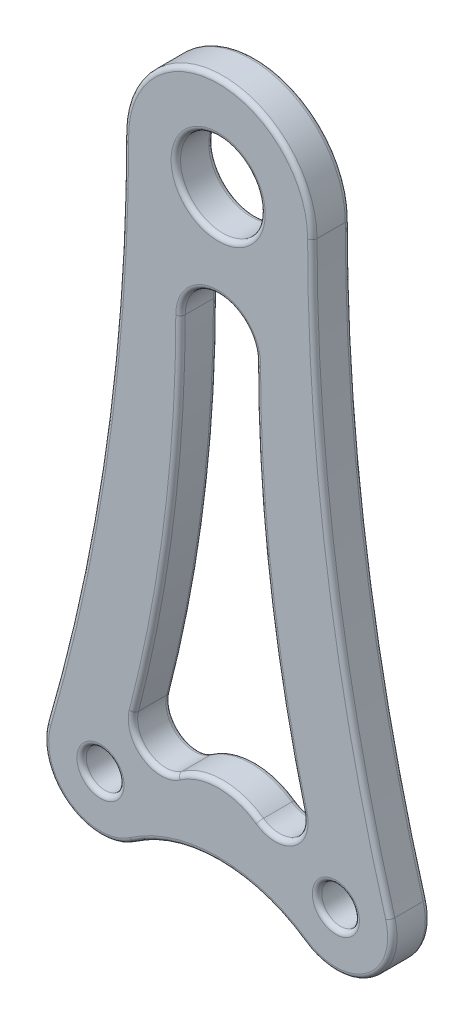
ISO-10303-21;
HEADER;
FILE_DESCRIPTION(('STEP AP214'),'2;1');
FILE_NAME('part.step','',(''),(''),'','','');
FILE_SCHEMA(('AUTOMOTIVE_DESIGN { 1 0 10303 214 1 1 1 1 }'));
ENDSEC;
DATA;
#1=APPLICATION_CONTEXT('core data for automotive mechanical design processes');
#2=APPLICATION_PROTOCOL_DEFINITION('international standard','automotive_design',2000,#1);
#3=PRODUCT_CONTEXT('',#1,'mechanical');
#4=PRODUCT('Part','Part','',(#3));
#5=PRODUCT_RELATED_PRODUCT_CATEGORY('part','',(#4));
#6=PRODUCT_DEFINITION_FORMATION('','',#4);
#7=PRODUCT_DEFINITION_CONTEXT('part definition',#1,'design');
#8=PRODUCT_DEFINITION('design','',#6,#7);
#9=PRODUCT_DEFINITION_SHAPE('','',#8);
#10=(LENGTH_UNIT() NAMED_UNIT(*) SI_UNIT(.MILLI.,.METRE.));
#11=(NAMED_UNIT(*) PLANE_ANGLE_UNIT() SI_UNIT($,.RADIAN.));
#12=(NAMED_UNIT(*) SI_UNIT($,.STERADIAN.) SOLID_ANGLE_UNIT());
#13=UNCERTAINTY_MEASURE_WITH_UNIT(LENGTH_MEASURE(1.E-05),#10,'distance_accuracy_value','');
#14=(GEOMETRIC_REPRESENTATION_CONTEXT(3) GLOBAL_UNCERTAINTY_ASSIGNED_CONTEXT((#13)) GLOBAL_UNIT_ASSIGNED_CONTEXT((#10,
#11,#12)) REPRESENTATION_CONTEXT('',''));
#15=CARTESIAN_POINT('',(0.,0.,0.));
#16=DIRECTION('',(0.,0.,1.));
#17=DIRECTION('',(1.,0.,0.));
#18=AXIS2_PLACEMENT_3D('',#15,#16,#17);
#19=CARTESIAN_POINT('',(-6.24999999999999,-69.0519334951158,2.));
#20=DIRECTION('',(0.,0.,1.));
#21=DIRECTION('',(1.,0.,0.));
#22=AXIS2_PLACEMENT_3D('',#19,#20,#21);
#23=PLANE('',#22);
#24=CARTESIAN_POINT('',(12.5,-60.,2.));
#25=DIRECTION('',(0.,0.,1.));
#26=DIRECTION('',(1.,0.,0.));
#27=AXIS2_PLACEMENT_3D('',#24,#25,#26);
#28=CIRCLE('',#27,2.5);
#29=CARTESIAN_POINT('',(15.,-60.,2.));
#30=VERTEX_POINT('',#29);
#31=EDGE_CURVE('E11',#30,#30,#28,.F.);
#32=ORIENTED_EDGE('',*,*,#31,.T.);
#33=EDGE_LOOP('',(#32));
#34=FACE_BOUND('',#33,.T.);
#35=CARTESIAN_POINT('',(0.,-14.,2.));
#36=DIRECTION('',(0.,0.,1.));
#37=DIRECTION('',(1.,0.,0.));
#38=AXIS2_PLACEMENT_3D('',#35,#36,#37);
#39=CIRCLE('',#38,4.5);
#40=CARTESIAN_POINT('',(-4.5,-14.,2.));
#41=VERTEX_POINT('',#40);
#42=CARTESIAN_POINT('',(4.5,-14.,2.));
#43=VERTEX_POINT('',#42);
#44=EDGE_CURVE('E47',#41,#43,#39,.F.);
#45=ORIENTED_EDGE('',*,*,#44,.T.);
#46=CARTESIAN_POINT('',(159.573514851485,-14.,2.));
#47=DIRECTION('',(0.,0.,1.));
#48=DIRECTION('',(1.,0.,0.));
#49=AXIS2_PLACEMENT_3D('',#46,#47,#48);
#50=CIRCLE('',#49,155.073514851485);
#51=CARTESIAN_POINT('',(9.43853750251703,-52.8237502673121,2.));
#52=VERTEX_POINT('',#51);
#53=EDGE_CURVE('E39',#43,#52,#50,.T.);
#54=ORIENTED_EDGE('',*,*,#53,.T.);
#55=CARTESIAN_POINT('',(6.05,-53.7,2.));
#56=DIRECTION('',(0.,0.,1.));
#57=DIRECTION('',(1.,0.,0.));
#58=AXIS2_PLACEMENT_3D('',#55,#56,#57);
#59=CIRCLE('',#58,3.5);
#60=CARTESIAN_POINT('',(4.03333333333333,-56.5606040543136,2.));
#61=VERTEX_POINT('',#60);
#62=EDGE_CURVE('E329',#52,#61,#59,.F.);
#63=ORIENTED_EDGE('',*,*,#62,.T.);
#64=CARTESIAN_POINT('',(0.,-62.2818121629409,2.));
#65=DIRECTION('',(0.,0.,1.));
#66=DIRECTION('',(1.,0.,0.));
#67=AXIS2_PLACEMENT_3D('',#64,#65,#66);
#68=CIRCLE('',#67,6.99999999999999);
#69=CARTESIAN_POINT('',(-4.03333333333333,-56.5606040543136,2.));
#70=VERTEX_POINT('',#69);
#71=EDGE_CURVE('E331',#61,#70,#68,.T.);
#72=ORIENTED_EDGE('',*,*,#71,.T.);
#73=CARTESIAN_POINT('',(-6.04999999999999,-53.7,2.));
#74=DIRECTION('',(0.,0.,1.));
#75=DIRECTION('',(1.,0.,0.));
#76=AXIS2_PLACEMENT_3D('',#73,#74,#75);
#77=CIRCLE('',#76,3.5);
#78=CARTESIAN_POINT('',(-9.43853750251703,-52.8237502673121,2.));
#79=VERTEX_POINT('',#78);
#80=EDGE_CURVE('E333',#70,#79,#77,.F.);
#81=ORIENTED_EDGE('',*,*,#80,.T.);
#82=CARTESIAN_POINT('',(-159.573514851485,-14.,2.));
#83=DIRECTION('',(0.,0.,1.));
#84=DIRECTION('',(1.,0.,0.));
#85=AXIS2_PLACEMENT_3D('',#82,#83,#84);
#86=CIRCLE('',#85,155.073514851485);
#87=EDGE_CURVE('E52',#79,#41,#86,.T.);
#88=ORIENTED_EDGE('',*,*,#87,.T.);
#89=EDGE_LOOP('',(#45,#54,#63,#72,#81,#88));
#90=FACE_BOUND('',#89,.T.);
#91=CARTESIAN_POINT('',(-220.014705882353,0.,2.));
#92=DIRECTION('',(0.,0.,1.));
#93=DIRECTION('',(1.,0.,0.));
#94=AXIS2_PLACEMENT_3D('',#91,#92,#93);
#95=CIRCLE('',#94,210.514705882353);
#96=CARTESIAN_POINT('',(-9.5,0.,2.));
#97=VERTEX_POINT('',#96);
#98=CARTESIAN_POINT('',(-17.7835795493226,-58.4723262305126,2.));
#99=VERTEX_POINT('',#98);
#100=EDGE_CURVE('E324',#97,#99,#95,.F.);
#101=ORIENTED_EDGE('',*,*,#100,.T.);
#102=CARTESIAN_POINT('',(-12.5,-60.,2.));
#103=DIRECTION('',(0.,0.,1.));
#104=DIRECTION('',(1.,0.,0.));
#105=AXIS2_PLACEMENT_3D('',#102,#103,#104);
#106=CIRCLE('',#105,5.5);
#107=CARTESIAN_POINT('',(-9.37499999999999,-64.5259667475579,2.));
#108=VERTEX_POINT('',#107);
#109=EDGE_CURVE('E326',#99,#108,#106,.T.);
#110=ORIENTED_EDGE('',*,*,#109,.T.);
#111=CARTESIAN_POINT('',(0.,-78.1038669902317,2.));
#112=DIRECTION('',(0.,0.,1.));
#113=DIRECTION('',(1.,0.,0.));
#114=AXIS2_PLACEMENT_3D('',#111,#112,#113);
#115=CIRCLE('',#114,16.5);
#116=CARTESIAN_POINT('',(9.37500000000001,-64.5259667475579,2.));
#117=VERTEX_POINT('',#116);
#118=EDGE_CURVE('E316',#108,#117,#115,.F.);
#119=ORIENTED_EDGE('',*,*,#118,.T.);
#120=CARTESIAN_POINT('',(12.5,-60.,2.));
#121=DIRECTION('',(0.,0.,1.));
#122=DIRECTION('',(1.,0.,0.));
#123=AXIS2_PLACEMENT_3D('',#120,#121,#122);
#124=CIRCLE('',#123,5.5);
#125=CARTESIAN_POINT('',(17.7835795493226,-58.4723262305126,2.));
#126=VERTEX_POINT('',#125);
#127=EDGE_CURVE('E318',#117,#126,#124,.T.);
#128=ORIENTED_EDGE('',*,*,#127,.T.);
#129=CARTESIAN_POINT('',(220.014705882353,0.,2.));
#130=DIRECTION('',(0.,0.,1.));
#131=DIRECTION('',(1.,0.,0.));
#132=AXIS2_PLACEMENT_3D('',#129,#130,#131);
#133=CIRCLE('',#132,210.514705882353);
#134=CARTESIAN_POINT('',(9.49999999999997,0.,2.));
#135=VERTEX_POINT('',#134);
#136=EDGE_CURVE('E320',#126,#135,#133,.F.);
#137=ORIENTED_EDGE('',*,*,#136,.T.);
#138=CARTESIAN_POINT('',(0.,0.,2.));
#139=DIRECTION('',(0.,0.,1.));
#140=DIRECTION('',(1.,0.,0.));
#141=AXIS2_PLACEMENT_3D('',#138,#139,#140);
#142=CIRCLE('',#141,9.5);
#143=EDGE_CURVE('E322',#135,#97,#142,.T.);
#144=ORIENTED_EDGE('',*,*,#143,.T.);
#145=EDGE_LOOP('',(#101,#110,#119,#128,#137,#144));
#146=FACE_BOUND('',#145,.T.);
#147=CARTESIAN_POINT('',(0.,0.,2.));
#148=DIRECTION('',(0.,0.,1.));
#149=DIRECTION('',(1.,0.,0.));
#150=AXIS2_PLACEMENT_3D('',#147,#148,#149);
#151=CIRCLE('',#150,5.);
#152=CARTESIAN_POINT('',(5.,0.,2.));
#153=VERTEX_POINT('',#152);
#154=EDGE_CURVE('E313',#153,#153,#151,.F.);
#155=ORIENTED_EDGE('',*,*,#154,.T.);
#156=EDGE_LOOP('',(#155));
#157=FACE_BOUND('',#156,.T.);
#158=CARTESIAN_POINT('',(-12.5,-60.,2.));
#159=DIRECTION('',(0.,0.,1.));
#160=DIRECTION('',(1.,0.,0.));
#161=AXIS2_PLACEMENT_3D('',#158,#159,#160);
#162=CIRCLE('',#161,2.5);
#163=CARTESIAN_POINT('',(-9.99999999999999,-60.,2.));
#164=VERTEX_POINT('',#163);
#165=EDGE_CURVE('E310',#164,#164,#162,.F.);
#166=ORIENTED_EDGE('',*,*,#165,.T.);
#167=EDGE_LOOP('',(#166));
#168=FACE_BOUND('',#167,.T.);
#169=ADVANCED_FACE('F30',(#34,#90,#146,#157,#168),#23,.T.);
#170=CARTESIAN_POINT('',(-6.24999999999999,-69.0519334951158,-2.));
#171=DIRECTION('',(0.,0.,1.));
#172=DIRECTION('',(1.,0.,0.));
#173=AXIS2_PLACEMENT_3D('',#170,#171,#172);
#174=PLANE('',#173);
#175=CARTESIAN_POINT('',(12.5,-60.,-2.));
#176=DIRECTION('',(0.,0.,1.));
#177=DIRECTION('',(1.,0.,0.));
#178=AXIS2_PLACEMENT_3D('',#175,#176,#177);
#179=CIRCLE('',#178,2.5);
#180=CARTESIAN_POINT('',(15.,-60.,-2.));
#181=VERTEX_POINT('',#180);
#182=EDGE_CURVE('E239',#181,#181,#179,.T.);
#183=ORIENTED_EDGE('',*,*,#182,.T.);
#184=EDGE_LOOP('',(#183));
#185=FACE_BOUND('',#184,.T.);
#186=CARTESIAN_POINT('',(-159.573514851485,-14.,-2.));
#187=DIRECTION('',(0.,0.,1.));
#188=DIRECTION('',(1.,0.,0.));
#189=AXIS2_PLACEMENT_3D('',#186,#187,#188);
#190=CIRCLE('',#189,155.073514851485);
#191=CARTESIAN_POINT('',(-4.5,-14.,-2.));
#192=VERTEX_POINT('',#191);
#193=CARTESIAN_POINT('',(-9.43853750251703,-52.8237502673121,-2.));
#194=VERTEX_POINT('',#193);
#195=EDGE_CURVE('E234',#192,#194,#190,.F.);
#196=ORIENTED_EDGE('',*,*,#195,.T.);
#197=CARTESIAN_POINT('',(-6.04999999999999,-53.7,-2.));
#198=DIRECTION('',(0.,0.,1.));
#199=DIRECTION('',(1.,0.,0.));
#200=AXIS2_PLACEMENT_3D('',#197,#198,#199);
#201=CIRCLE('',#200,3.5);
#202=CARTESIAN_POINT('',(-4.03333333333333,-56.5606040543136,-2.));
#203=VERTEX_POINT('',#202);
#204=EDGE_CURVE('E236',#194,#203,#201,.T.);
#205=ORIENTED_EDGE('',*,*,#204,.T.);
#206=CARTESIAN_POINT('',(0.,-62.2818121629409,-2.));
#207=DIRECTION('',(0.,0.,1.));
#208=DIRECTION('',(1.,0.,0.));
#209=AXIS2_PLACEMENT_3D('',#206,#207,#208);
#210=CIRCLE('',#209,6.99999999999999);
#211=CARTESIAN_POINT('',(4.03333333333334,-56.5606040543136,-2.));
#212=VERTEX_POINT('',#211);
#213=EDGE_CURVE('E221',#203,#212,#210,.F.);
#214=ORIENTED_EDGE('',*,*,#213,.T.);
#215=CARTESIAN_POINT('',(6.05,-53.7,-2.));
#216=DIRECTION('',(0.,0.,1.));
#217=DIRECTION('',(1.,0.,0.));
#218=AXIS2_PLACEMENT_3D('',#215,#216,#217);
#219=CIRCLE('',#218,3.5);
#220=CARTESIAN_POINT('',(9.43853750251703,-52.8237502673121,-2.));
#221=VERTEX_POINT('',#220);
#222=EDGE_CURVE('E223',#212,#221,#219,.T.);
#223=ORIENTED_EDGE('',*,*,#222,.T.);
#224=CARTESIAN_POINT('',(159.573514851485,-14.,-2.));
#225=DIRECTION('',(0.,0.,1.));
#226=DIRECTION('',(1.,0.,0.));
#227=AXIS2_PLACEMENT_3D('',#224,#225,#226);
#228=CIRCLE('',#227,155.073514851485);
#229=CARTESIAN_POINT('',(4.5,-14.,-2.));
#230=VERTEX_POINT('',#229);
#231=EDGE_CURVE('E230',#221,#230,#228,.F.);
#232=ORIENTED_EDGE('',*,*,#231,.T.);
#233=CARTESIAN_POINT('',(0.,-14.,-2.));
#234=DIRECTION('',(0.,0.,1.));
#235=DIRECTION('',(1.,0.,0.));
#236=AXIS2_PLACEMENT_3D('',#233,#234,#235);
#237=CIRCLE('',#236,4.5);
#238=EDGE_CURVE('E232',#230,#192,#237,.T.);
#239=ORIENTED_EDGE('',*,*,#238,.T.);
#240=EDGE_LOOP('',(#196,#205,#214,#223,#232,#239));
#241=FACE_BOUND('',#240,.T.);
#242=CARTESIAN_POINT('',(220.014705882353,0.,-2.));
#243=DIRECTION('',(0.,0.,1.));
#244=DIRECTION('',(1.,0.,0.));
#245=AXIS2_PLACEMENT_3D('',#242,#243,#244);
#246=CIRCLE('',#245,210.514705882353);
#247=CARTESIAN_POINT('',(9.5,0.,-2.));
#248=VERTEX_POINT('',#247);
#249=CARTESIAN_POINT('',(17.7835795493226,-58.4723262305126,-2.));
#250=VERTEX_POINT('',#249);
#251=EDGE_CURVE('E220',#248,#250,#246,.T.);
#252=ORIENTED_EDGE('',*,*,#251,.T.);
#253=CARTESIAN_POINT('',(12.5,-60.,-2.));
#254=DIRECTION('',(0.,0.,1.));
#255=DIRECTION('',(1.,0.,0.));
#256=AXIS2_PLACEMENT_3D('',#253,#254,#255);
#257=CIRCLE('',#256,5.5);
#258=CARTESIAN_POINT('',(9.37500000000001,-64.5259667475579,-2.));
#259=VERTEX_POINT('',#258);
#260=EDGE_CURVE('E198',#250,#259,#257,.F.);
#261=ORIENTED_EDGE('',*,*,#260,.T.);
#262=CARTESIAN_POINT('',(0.,-78.1038669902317,-2.));
#263=DIRECTION('',(0.,0.,1.));
#264=DIRECTION('',(1.,0.,0.));
#265=AXIS2_PLACEMENT_3D('',#262,#263,#264);
#266=CIRCLE('',#265,16.5);
#267=CARTESIAN_POINT('',(-9.37499999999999,-64.5259667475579,-2.));
#268=VERTEX_POINT('',#267);
#269=EDGE_CURVE('E208',#259,#268,#266,.T.);
#270=ORIENTED_EDGE('',*,*,#269,.T.);
#271=CARTESIAN_POINT('',(-12.5,-60.,-2.));
#272=DIRECTION('',(0.,0.,1.));
#273=DIRECTION('',(1.,0.,0.));
#274=AXIS2_PLACEMENT_3D('',#271,#272,#273);
#275=CIRCLE('',#274,5.5);
#276=CARTESIAN_POINT('',(-17.7835795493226,-58.4723262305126,-2.));
#277=VERTEX_POINT('',#276);
#278=EDGE_CURVE('E214',#268,#277,#275,.F.);
#279=ORIENTED_EDGE('',*,*,#278,.T.);
#280=CARTESIAN_POINT('',(-220.014705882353,0.,-2.));
#281=DIRECTION('',(0.,0.,1.));
#282=DIRECTION('',(1.,0.,0.));
#283=AXIS2_PLACEMENT_3D('',#280,#281,#282);
#284=CIRCLE('',#283,210.514705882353);
#285=CARTESIAN_POINT('',(-9.49999999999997,0.,-2.));
#286=VERTEX_POINT('',#285);
#287=EDGE_CURVE('E432',#277,#286,#284,.T.);
#288=ORIENTED_EDGE('',*,*,#287,.T.);
#289=CARTESIAN_POINT('',(0.,0.,-2.));
#290=DIRECTION('',(0.,0.,1.));
#291=DIRECTION('',(1.,0.,0.));
#292=AXIS2_PLACEMENT_3D('',#289,#290,#291);
#293=CIRCLE('',#292,9.5);
#294=EDGE_CURVE('E225',#286,#248,#293,.F.);
#295=ORIENTED_EDGE('',*,*,#294,.T.);
#296=EDGE_LOOP('',(#252,#261,#270,#279,#288,#295));
#297=FACE_BOUND('',#296,.T.);
#298=CARTESIAN_POINT('',(0.,0.,-2.));
#299=DIRECTION('',(0.,0.,1.));
#300=DIRECTION('',(1.,0.,0.));
#301=AXIS2_PLACEMENT_3D('',#298,#299,#300);
#302=CIRCLE('',#301,5.);
#303=CARTESIAN_POINT('',(5.,0.,-2.));
#304=VERTEX_POINT('',#303);
#305=EDGE_CURVE('E215',#304,#304,#302,.T.);
#306=ORIENTED_EDGE('',*,*,#305,.T.);
#307=EDGE_LOOP('',(#306));
#308=FACE_BOUND('',#307,.T.);
#309=CARTESIAN_POINT('',(-12.5,-60.,-2.));
#310=DIRECTION('',(0.,0.,1.));
#311=DIRECTION('',(1.,0.,0.));
#312=AXIS2_PLACEMENT_3D('',#309,#310,#311);
#313=CIRCLE('',#312,2.5);
#314=CARTESIAN_POINT('',(-9.99999999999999,-60.,-2.));
#315=VERTEX_POINT('',#314);
#316=EDGE_CURVE('E421',#315,#315,#313,.T.);
#317=ORIENTED_EDGE('',*,*,#316,.T.);
#318=EDGE_LOOP('',(#317));
#319=FACE_BOUND('',#318,.T.);
#320=ADVANCED_FACE('F217',(#185,#241,#297,#308,#319),#174,.F.);
#321=CARTESIAN_POINT('',(0.,-78.1038669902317,2.));
#322=DIRECTION('',(0.,0.,-1.));
#323=DIRECTION('',(-1.,0.,0.));
#324=AXIS2_PLACEMENT_3D('',#321,#322,#323);
#325=CYLINDRICAL_SURFACE('',#324,16.);
#326=DIRECTION('',(0.,0.,-1.));
#327=VECTOR('',#326,1.);
#328=CARTESIAN_POINT('',(-9.09090909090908,-64.9374182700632,2.));
#329=LINE('',#328,#327);
#330=CARTESIAN_POINT('',(-9.09090909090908,-64.9374182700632,1.5));
#331=VERTEX_POINT('',#330);
#332=CARTESIAN_POINT('',(-9.09090909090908,-64.9374182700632,-1.5));
#333=VERTEX_POINT('',#332);
#334=EDGE_CURVE('E451',#331,#333,#329,.T.);
#335=ORIENTED_EDGE('',*,*,#334,.T.);
#336=CARTESIAN_POINT('',(0.,-78.1038669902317,-1.5));
#337=DIRECTION('',(0.,0.,1.));
#338=DIRECTION('',(1.,0.,0.));
#339=AXIS2_PLACEMENT_3D('',#336,#337,#338);
#340=CIRCLE('',#339,16.);
#341=CARTESIAN_POINT('',(9.0909090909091,-64.9374182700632,-1.5));
#342=VERTEX_POINT('',#341);
#343=EDGE_CURVE('E296',#333,#342,#340,.F.);
#344=ORIENTED_EDGE('',*,*,#343,.T.);
#345=DIRECTION('',(0.,0.,-1.));
#346=VECTOR('',#345,1.);
#347=CARTESIAN_POINT('',(9.0909090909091,-64.9374182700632,2.));
#348=LINE('',#347,#346);
#349=CARTESIAN_POINT('',(9.0909090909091,-64.9374182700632,1.5));
#350=VERTEX_POINT('',#349);
#351=EDGE_CURVE('E419',#350,#342,#348,.T.);
#352=ORIENTED_EDGE('',*,*,#351,.F.);
#353=CARTESIAN_POINT('',(0.,-78.1038669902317,1.5));
#354=DIRECTION('',(0.,0.,1.));
#355=DIRECTION('',(1.,0.,0.));
#356=AXIS2_PLACEMENT_3D('',#353,#354,#355);
#357=CIRCLE('',#356,16.);
#358=EDGE_CURVE('E294',#350,#331,#357,.T.);
#359=ORIENTED_EDGE('',*,*,#358,.T.);
#360=EDGE_LOOP('',(#335,#344,#352,#359));
#361=FACE_BOUND('',#360,.T.);
#362=ADVANCED_FACE('F561',(#361),#325,.F.);
#363=CARTESIAN_POINT('',(12.5,-60.,2.));
#364=DIRECTION('',(0.,0.,-1.));
#365=DIRECTION('',(-1.,0.,0.));
#366=AXIS2_PLACEMENT_3D('',#363,#364,#365);
#367=CYLINDRICAL_SURFACE('',#366,6.);
#368=ORIENTED_EDGE('',*,*,#351,.T.);
#369=CARTESIAN_POINT('',(12.5,-60.,-1.5));
#370=DIRECTION('',(0.,0.,1.));
#371=DIRECTION('',(1.,0.,0.));
#372=AXIS2_PLACEMENT_3D('',#369,#370,#371);
#373=CIRCLE('',#372,6.);
#374=CARTESIAN_POINT('',(18.2639049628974,-58.3334467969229,-1.5));
#375=VERTEX_POINT('',#374);
#376=EDGE_CURVE('E201',#342,#375,#373,.T.);
#377=ORIENTED_EDGE('',*,*,#376,.T.);
#378=DIRECTION('',(0.,0.,-1.));
#379=VECTOR('',#378,1.);
#380=CARTESIAN_POINT('',(18.2639049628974,-58.3334467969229,2.));
#381=LINE('',#380,#379);
#382=CARTESIAN_POINT('',(18.2639049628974,-58.3334467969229,1.5));
#383=VERTEX_POINT('',#382);
#384=EDGE_CURVE('E412',#383,#375,#381,.T.);
#385=ORIENTED_EDGE('',*,*,#384,.F.);
#386=CARTESIAN_POINT('',(12.5,-60.,1.5));
#387=DIRECTION('',(0.,0.,1.));
#388=DIRECTION('',(1.,0.,0.));
#389=AXIS2_PLACEMENT_3D('',#386,#387,#388);
#390=CIRCLE('',#389,6.);
#391=EDGE_CURVE('E274',#383,#350,#390,.F.);
#392=ORIENTED_EDGE('',*,*,#391,.T.);
#393=EDGE_LOOP('',(#368,#377,#385,#392));
#394=FACE_BOUND('',#393,.T.);
#395=ADVANCED_FACE('F417',(#394),#367,.T.);
#396=CARTESIAN_POINT('',(220.014705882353,0.,2.));
#397=DIRECTION('',(0.,0.,-1.));
#398=DIRECTION('',(-1.,0.,0.));
#399=AXIS2_PLACEMENT_3D('',#396,#397,#398);
#400=CYLINDRICAL_SURFACE('',#399,210.014705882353);
#401=ORIENTED_EDGE('',*,*,#384,.T.);
#402=CARTESIAN_POINT('',(220.014705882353,0.,-1.5));
#403=DIRECTION('',(0.,0.,1.));
#404=DIRECTION('',(1.,0.,0.));
#405=AXIS2_PLACEMENT_3D('',#402,#403,#404);
#406=CIRCLE('',#405,210.014705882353);
#407=CARTESIAN_POINT('',(10.,0.,-1.5));
#408=VERTEX_POINT('',#407);
#409=EDGE_CURVE('E279',#375,#408,#406,.F.);
#410=ORIENTED_EDGE('',*,*,#409,.T.);
#411=DIRECTION('',(0.,0.,-1.));
#412=VECTOR('',#411,1.);
#413=CARTESIAN_POINT('',(10.,0.,2.));
#414=LINE('',#413,#412);
#415=CARTESIAN_POINT('',(10.,0.,1.5));
#416=VERTEX_POINT('',#415);
#417=EDGE_CURVE('E414',#416,#408,#414,.T.);
#418=ORIENTED_EDGE('',*,*,#417,.F.);
#419=CARTESIAN_POINT('',(220.014705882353,0.,1.5));
#420=DIRECTION('',(0.,0.,1.));
#421=DIRECTION('',(1.,0.,0.));
#422=AXIS2_PLACEMENT_3D('',#419,#420,#421);
#423=CIRCLE('',#422,210.014705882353);
#424=EDGE_CURVE('E277',#416,#383,#423,.T.);
#425=ORIENTED_EDGE('',*,*,#424,.T.);
#426=EDGE_LOOP('',(#401,#410,#418,#425));
#427=FACE_BOUND('',#426,.T.);
#428=ADVANCED_FACE('F411',(#427),#400,.F.);
#429=CARTESIAN_POINT('',(0.,0.,2.));
#430=DIRECTION('',(0.,0.,-1.));
#431=DIRECTION('',(-1.,0.,0.));
#432=AXIS2_PLACEMENT_3D('',#429,#430,#431);
#433=CYLINDRICAL_SURFACE('',#432,10.);
#434=ORIENTED_EDGE('',*,*,#417,.T.);
#435=CARTESIAN_POINT('',(0.,0.,-1.5));
#436=DIRECTION('',(0.,0.,1.));
#437=DIRECTION('',(1.,0.,0.));
#438=AXIS2_PLACEMENT_3D('',#435,#436,#437);
#439=CIRCLE('',#438,10.);
#440=CARTESIAN_POINT('',(-9.99999999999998,0.,-1.5));
#441=VERTEX_POINT('',#440);
#442=EDGE_CURVE('E283',#408,#441,#439,.T.);
#443=ORIENTED_EDGE('',*,*,#442,.T.);
#444=DIRECTION('',(0.,0.,-1.));
#445=VECTOR('',#444,1.);
#446=CARTESIAN_POINT('',(-9.99999999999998,0.,2.));
#447=LINE('',#446,#445);
#448=CARTESIAN_POINT('',(-9.99999999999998,0.,1.5));
#449=VERTEX_POINT('',#448);
#450=EDGE_CURVE('E423',#449,#441,#447,.T.);
#451=ORIENTED_EDGE('',*,*,#450,.F.);
#452=CARTESIAN_POINT('',(0.,0.,1.5));
#453=DIRECTION('',(0.,0.,1.));
#454=DIRECTION('',(1.,0.,0.));
#455=AXIS2_PLACEMENT_3D('',#452,#453,#454);
#456=CIRCLE('',#455,10.);
#457=EDGE_CURVE('E281',#449,#416,#456,.F.);
#458=ORIENTED_EDGE('',*,*,#457,.T.);
#459=EDGE_LOOP('',(#434,#443,#451,#458));
#460=FACE_BOUND('',#459,.T.);
#461=ADVANCED_FACE('F444',(#460),#433,.T.);
#462=CARTESIAN_POINT('',(-220.014705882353,0.,2.));
#463=DIRECTION('',(0.,0.,-1.));
#464=DIRECTION('',(-1.,0.,0.));
#465=AXIS2_PLACEMENT_3D('',#462,#463,#464);
#466=CYLINDRICAL_SURFACE('',#465,210.014705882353);
#467=ORIENTED_EDGE('',*,*,#450,.T.);
#468=CARTESIAN_POINT('',(-220.014705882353,0.,-1.5));
#469=DIRECTION('',(0.,0.,1.));
#470=DIRECTION('',(1.,0.,0.));
#471=AXIS2_PLACEMENT_3D('',#468,#469,#470);
#472=CIRCLE('',#471,210.014705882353);
#473=CARTESIAN_POINT('',(-18.2639049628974,-58.3334467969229,-1.5));
#474=VERTEX_POINT('',#473);
#475=EDGE_CURVE('E287',#441,#474,#472,.F.);
#476=ORIENTED_EDGE('',*,*,#475,.T.);
#477=DIRECTION('',(0.,0.,-1.));
#478=VECTOR('',#477,1.);
#479=CARTESIAN_POINT('',(-18.2639049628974,-58.3334467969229,2.));
#480=LINE('',#479,#478);
#481=CARTESIAN_POINT('',(-18.2639049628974,-58.3334467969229,1.5));
#482=VERTEX_POINT('',#481);
#483=EDGE_CURVE('E449',#482,#474,#480,.T.);
#484=ORIENTED_EDGE('',*,*,#483,.F.);
#485=CARTESIAN_POINT('',(-220.014705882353,0.,1.5));
#486=DIRECTION('',(0.,0.,1.));
#487=DIRECTION('',(1.,0.,0.));
#488=AXIS2_PLACEMENT_3D('',#485,#486,#487);
#489=CIRCLE('',#488,210.014705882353);
#490=EDGE_CURVE('E285',#482,#449,#489,.T.);
#491=ORIENTED_EDGE('',*,*,#490,.T.);
#492=EDGE_LOOP('',(#467,#476,#484,#491));
#493=FACE_BOUND('',#492,.T.);
#494=ADVANCED_FACE('F571',(#493),#466,.F.);
#495=CARTESIAN_POINT('',(-12.5,-60.,2.));
#496=DIRECTION('',(0.,0.,-1.));
#497=DIRECTION('',(-1.,0.,0.));
#498=AXIS2_PLACEMENT_3D('',#495,#496,#497);
#499=CYLINDRICAL_SURFACE('',#498,6.);
#500=ORIENTED_EDGE('',*,*,#483,.T.);
#501=CARTESIAN_POINT('',(-12.5,-60.,-1.5));
#502=DIRECTION('',(0.,0.,1.));
#503=DIRECTION('',(1.,0.,0.));
#504=AXIS2_PLACEMENT_3D('',#501,#502,#503);
#505=CIRCLE('',#504,6.);
#506=EDGE_CURVE('E292',#474,#333,#505,.T.);
#507=ORIENTED_EDGE('',*,*,#506,.T.);
#508=ORIENTED_EDGE('',*,*,#334,.F.);
#509=CARTESIAN_POINT('',(-12.5,-60.,1.5));
#510=DIRECTION('',(0.,0.,1.));
#511=DIRECTION('',(1.,0.,0.));
#512=AXIS2_PLACEMENT_3D('',#509,#510,#511);
#513=CIRCLE('',#512,6.);
#514=EDGE_CURVE('E289',#331,#482,#513,.F.);
#515=ORIENTED_EDGE('',*,*,#514,.T.);
#516=EDGE_LOOP('',(#500,#507,#508,#515));
#517=FACE_BOUND('',#516,.T.);
#518=ADVANCED_FACE('F568',(#517),#499,.T.);
#519=CARTESIAN_POINT('',(0.,0.,2.));
#520=DIRECTION('',(0.,0.,-1.));
#521=DIRECTION('',(-1.,0.,0.));
#522=AXIS2_PLACEMENT_3D('',#519,#520,#521);
#523=CYLINDRICAL_SURFACE('',#522,4.5);
#524=CARTESIAN_POINT('',(0.,0.,-1.5));
#525=DIRECTION('',(0.,0.,1.));
#526=DIRECTION('',(1.,0.,0.));
#527=AXIS2_PLACEMENT_3D('',#524,#525,#526);
#528=CIRCLE('',#527,4.5);
#529=CARTESIAN_POINT('',(4.5,0.,-1.5));
#530=VERTEX_POINT('',#529);
#531=EDGE_CURVE('E301',#530,#530,#528,.F.);
#532=ORIENTED_EDGE('',*,*,#531,.T.);
#533=EDGE_LOOP('',(#532));
#534=FACE_BOUND('',#533,.T.);
#535=CARTESIAN_POINT('',(0.,0.,1.5));
#536=DIRECTION('',(0.,0.,1.));
#537=DIRECTION('',(1.,0.,0.));
#538=AXIS2_PLACEMENT_3D('',#535,#536,#537);
#539=CIRCLE('',#538,4.5);
#540=CARTESIAN_POINT('',(4.5,0.,1.5));
#541=VERTEX_POINT('',#540);
#542=EDGE_CURVE('E298',#541,#541,#539,.T.);
#543=ORIENTED_EDGE('',*,*,#542,.T.);
#544=EDGE_LOOP('',(#543));
#545=FACE_BOUND('',#544,.T.);
#546=ADVANCED_FACE('F565',(#534,#545),#523,.F.);
#547=CARTESIAN_POINT('',(0.,-62.2818121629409,2.));
#548=DIRECTION('',(0.,0.,-1.));
#549=DIRECTION('',(-1.,0.,0.));
#550=AXIS2_PLACEMENT_3D('',#547,#548,#549);
#551=CYLINDRICAL_SURFACE('',#550,7.49999999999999);
#552=DIRECTION('',(0.,0.,-1.));
#553=VECTOR('',#552,1.);
#554=CARTESIAN_POINT('',(4.32142857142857,-56.1519463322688,2.));
#555=LINE('',#554,#553);
#556=CARTESIAN_POINT('',(4.32142857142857,-56.1519463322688,1.5));
#557=VERTEX_POINT('',#556);
#558=CARTESIAN_POINT('',(4.32142857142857,-56.1519463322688,-1.5));
#559=VERTEX_POINT('',#558);
#560=EDGE_CURVE('E456',#557,#559,#555,.T.);
#561=ORIENTED_EDGE('',*,*,#560,.T.);
#562=CARTESIAN_POINT('',(0.,-62.2818121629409,-1.5));
#563=DIRECTION('',(0.,0.,1.));
#564=DIRECTION('',(1.,0.,0.));
#565=AXIS2_PLACEMENT_3D('',#562,#563,#564);
#566=CIRCLE('',#565,7.49999999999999);
#567=CARTESIAN_POINT('',(-4.32142857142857,-56.1519463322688,-1.5));
#568=VERTEX_POINT('',#567);
#569=EDGE_CURVE('E272',#559,#568,#566,.T.);
#570=ORIENTED_EDGE('',*,*,#569,.T.);
#571=DIRECTION('',(0.,0.,-1.));
#572=VECTOR('',#571,1.);
#573=CARTESIAN_POINT('',(-4.32142857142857,-56.1519463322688,2.));
#574=LINE('',#573,#572);
#575=CARTESIAN_POINT('',(-4.32142857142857,-56.1519463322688,1.5));
#576=VERTEX_POINT('',#575);
#577=EDGE_CURVE('E355',#576,#568,#574,.T.);
#578=ORIENTED_EDGE('',*,*,#577,.F.);
#579=CARTESIAN_POINT('',(0.,-62.2818121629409,1.5));
#580=DIRECTION('',(0.,0.,1.));
#581=DIRECTION('',(1.,0.,0.));
#582=AXIS2_PLACEMENT_3D('',#579,#580,#581);
#583=CIRCLE('',#582,7.49999999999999);
#584=EDGE_CURVE('E270',#576,#557,#583,.F.);
#585=ORIENTED_EDGE('',*,*,#584,.T.);
#586=EDGE_LOOP('',(#561,#570,#578,#585));
#587=FACE_BOUND('',#586,.T.);
#588=ADVANCED_FACE('F544',(#587),#551,.T.);
#589=CARTESIAN_POINT('',(6.05,-53.7,2.));
#590=DIRECTION('',(0.,0.,-1.));
#591=DIRECTION('',(-1.,0.,0.));
#592=AXIS2_PLACEMENT_3D('',#589,#590,#591);
#593=CYLINDRICAL_SURFACE('',#592,3.);
#594=DIRECTION('',(0.,0.,-1.));
#595=VECTOR('',#594,1.);
#596=CARTESIAN_POINT('',(8.95446071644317,-52.9489288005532,2.));
#597=LINE('',#596,#595);
#598=CARTESIAN_POINT('',(8.95446071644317,-52.9489288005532,1.5));
#599=VERTEX_POINT('',#598);
#600=CARTESIAN_POINT('',(8.95446071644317,-52.9489288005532,-1.5));
#601=VERTEX_POINT('',#600);
#602=EDGE_CURVE('E459',#599,#601,#597,.T.);
#603=ORIENTED_EDGE('',*,*,#602,.T.);
#604=CARTESIAN_POINT('',(6.05,-53.7,-1.5));
#605=DIRECTION('',(0.,0.,1.));
#606=DIRECTION('',(1.,0.,0.));
#607=AXIS2_PLACEMENT_3D('',#604,#605,#606);
#608=CIRCLE('',#607,3.);
#609=EDGE_CURVE('E268',#601,#559,#608,.F.);
#610=ORIENTED_EDGE('',*,*,#609,.T.);
#611=ORIENTED_EDGE('',*,*,#560,.F.);
#612=CARTESIAN_POINT('',(6.05,-53.7,1.5));
#613=DIRECTION('',(0.,0.,1.));
#614=DIRECTION('',(1.,0.,0.));
#615=AXIS2_PLACEMENT_3D('',#612,#613,#614);
#616=CIRCLE('',#615,3.);
#617=EDGE_CURVE('E266',#557,#599,#616,.T.);
#618=ORIENTED_EDGE('',*,*,#617,.T.);
#619=EDGE_LOOP('',(#603,#610,#611,#618));
#620=FACE_BOUND('',#619,.T.);
#621=ADVANCED_FACE('F521',(#620),#593,.F.);
#622=CARTESIAN_POINT('',(159.573514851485,-14.,2.));
#623=DIRECTION('',(0.,0.,-1.));
#624=DIRECTION('',(-1.,0.,0.));
#625=AXIS2_PLACEMENT_3D('',#622,#623,#624);
#626=CYLINDRICAL_SURFACE('',#625,155.573514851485);
#627=DIRECTION('',(0.,0.,-1.));
#628=VECTOR('',#627,1.);
#629=CARTESIAN_POINT('',(4.,-14.,2.));
#630=LINE('',#629,#628);
#631=CARTESIAN_POINT('',(4.,-14.,1.5));
#632=VERTEX_POINT('',#631);
#633=CARTESIAN_POINT('',(4.,-14.,-1.5));
#634=VERTEX_POINT('',#633);
#635=EDGE_CURVE('E462',#632,#634,#630,.T.);
#636=ORIENTED_EDGE('',*,*,#635,.T.);
#637=CARTESIAN_POINT('',(159.573514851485,-14.,-1.5));
#638=DIRECTION('',(0.,0.,1.));
#639=DIRECTION('',(1.,0.,0.));
#640=AXIS2_PLACEMENT_3D('',#637,#638,#639);
#641=CIRCLE('',#640,155.573514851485);
#642=EDGE_CURVE('E264',#634,#601,#641,.T.);
#643=ORIENTED_EDGE('',*,*,#642,.T.);
#644=ORIENTED_EDGE('',*,*,#602,.F.);
#645=CARTESIAN_POINT('',(159.573514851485,-14.,1.5));
#646=DIRECTION('',(0.,0.,1.));
#647=DIRECTION('',(1.,0.,0.));
#648=AXIS2_PLACEMENT_3D('',#645,#646,#647);
#649=CIRCLE('',#648,155.573514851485);
#650=EDGE_CURVE('E261',#599,#632,#649,.F.);
#651=ORIENTED_EDGE('',*,*,#650,.T.);
#652=EDGE_LOOP('',(#636,#643,#644,#651));
#653=FACE_BOUND('',#652,.T.);
#654=ADVANCED_FACE('F518',(#653),#626,.T.);
#655=CARTESIAN_POINT('',(0.,-14.,2.));
#656=DIRECTION('',(0.,0.,-1.));
#657=DIRECTION('',(-1.,0.,0.));
#658=AXIS2_PLACEMENT_3D('',#655,#656,#657);
#659=CYLINDRICAL_SURFACE('',#658,4.);
#660=DIRECTION('',(0.,0.,-1.));
#661=VECTOR('',#660,1.);
#662=CARTESIAN_POINT('',(-4.,-14.,2.));
#663=LINE('',#662,#661);
#664=CARTESIAN_POINT('',(-4.,-14.,1.5));
#665=VERTEX_POINT('',#664);
#666=CARTESIAN_POINT('',(-4.,-14.,-1.5));
#667=VERTEX_POINT('',#666);
#668=EDGE_CURVE('E465',#665,#667,#663,.T.);
#669=ORIENTED_EDGE('',*,*,#668,.T.);
#670=CARTESIAN_POINT('',(0.,-14.,-1.5));
#671=DIRECTION('',(0.,0.,1.));
#672=DIRECTION('',(1.,0.,0.));
#673=AXIS2_PLACEMENT_3D('',#670,#671,#672);
#674=CIRCLE('',#673,4.);
#675=EDGE_CURVE('E259',#667,#634,#674,.F.);
#676=ORIENTED_EDGE('',*,*,#675,.T.);
#677=ORIENTED_EDGE('',*,*,#635,.F.);
#678=CARTESIAN_POINT('',(0.,-14.,1.5));
#679=DIRECTION('',(0.,0.,1.));
#680=DIRECTION('',(1.,0.,0.));
#681=AXIS2_PLACEMENT_3D('',#678,#679,#680);
#682=CIRCLE('',#681,4.);
#683=EDGE_CURVE('E257',#632,#665,#682,.T.);
#684=ORIENTED_EDGE('',*,*,#683,.T.);
#685=EDGE_LOOP('',(#669,#676,#677,#684));
#686=FACE_BOUND('',#685,.T.);
#687=ADVANCED_FACE('F504',(#686),#659,.F.);
#688=CARTESIAN_POINT('',(-159.573514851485,-14.,2.));
#689=DIRECTION('',(0.,0.,-1.));
#690=DIRECTION('',(-1.,0.,0.));
#691=AXIS2_PLACEMENT_3D('',#688,#689,#690);
#692=CYLINDRICAL_SURFACE('',#691,155.573514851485);
#693=DIRECTION('',(0.,0.,-1.));
#694=VECTOR('',#693,1.);
#695=CARTESIAN_POINT('',(-8.95446071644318,-52.9489288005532,2.));
#696=LINE('',#695,#694);
#697=CARTESIAN_POINT('',(-8.95446071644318,-52.9489288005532,1.5));
#698=VERTEX_POINT('',#697);
#699=CARTESIAN_POINT('',(-8.95446071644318,-52.9489288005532,-1.5));
#700=VERTEX_POINT('',#699);
#701=EDGE_CURVE('E468',#698,#700,#696,.T.);
#702=ORIENTED_EDGE('',*,*,#701,.T.);
#703=CARTESIAN_POINT('',(-159.573514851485,-14.,-1.5));
#704=DIRECTION('',(0.,0.,1.));
#705=DIRECTION('',(1.,0.,0.));
#706=AXIS2_PLACEMENT_3D('',#703,#704,#705);
#707=CIRCLE('',#706,155.573514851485);
#708=EDGE_CURVE('E255',#700,#667,#707,.T.);
#709=ORIENTED_EDGE('',*,*,#708,.T.);
#710=ORIENTED_EDGE('',*,*,#668,.F.);
#711=CARTESIAN_POINT('',(-159.573514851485,-14.,1.5));
#712=DIRECTION('',(0.,0.,1.));
#713=DIRECTION('',(1.,0.,0.));
#714=AXIS2_PLACEMENT_3D('',#711,#712,#713);
#715=CIRCLE('',#714,155.573514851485);
#716=EDGE_CURVE('E253',#665,#698,#715,.F.);
#717=ORIENTED_EDGE('',*,*,#716,.T.);
#718=EDGE_LOOP('',(#702,#709,#710,#717));
#719=FACE_BOUND('',#718,.T.);
#720=ADVANCED_FACE('F500',(#719),#692,.T.);
#721=CARTESIAN_POINT('',(-6.04999999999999,-53.7,2.));
#722=DIRECTION('',(0.,0.,-1.));
#723=DIRECTION('',(-1.,0.,0.));
#724=AXIS2_PLACEMENT_3D('',#721,#722,#723);
#725=CYLINDRICAL_SURFACE('',#724,3.);
#726=ORIENTED_EDGE('',*,*,#577,.T.);
#727=CARTESIAN_POINT('',(-6.04999999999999,-53.7,-1.5));
#728=DIRECTION('',(0.,0.,1.));
#729=DIRECTION('',(1.,0.,0.));
#730=AXIS2_PLACEMENT_3D('',#727,#728,#729);
#731=CIRCLE('',#730,3.);
#732=EDGE_CURVE('E250',#568,#700,#731,.F.);
#733=ORIENTED_EDGE('',*,*,#732,.T.);
#734=ORIENTED_EDGE('',*,*,#701,.F.);
#735=CARTESIAN_POINT('',(-6.04999999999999,-53.7,1.5));
#736=DIRECTION('',(0.,0.,1.));
#737=DIRECTION('',(1.,0.,0.));
#738=AXIS2_PLACEMENT_3D('',#735,#736,#737);
#739=CIRCLE('',#738,3.);
#740=EDGE_CURVE('E248',#698,#576,#739,.T.);
#741=ORIENTED_EDGE('',*,*,#740,.T.);
#742=EDGE_LOOP('',(#726,#733,#734,#741));
#743=FACE_BOUND('',#742,.T.);
#744=ADVANCED_FACE('F475',(#743),#725,.F.);
#745=CARTESIAN_POINT('',(-12.5,-60.,2.));
#746=DIRECTION('',(0.,0.,-1.));
#747=DIRECTION('',(-1.,0.,0.));
#748=AXIS2_PLACEMENT_3D('',#745,#746,#747);
#749=CYLINDRICAL_SURFACE('',#748,2.);
#750=CARTESIAN_POINT('',(-12.5,-60.,-1.5));
#751=DIRECTION('',(0.,0.,1.));
#752=DIRECTION('',(1.,0.,0.));
#753=AXIS2_PLACEMENT_3D('',#750,#751,#752);
#754=CIRCLE('',#753,2.);
#755=CARTESIAN_POINT('',(-10.5,-60.,-1.5));
#756=VERTEX_POINT('',#755);
#757=EDGE_CURVE('E307',#756,#756,#754,.F.);
#758=ORIENTED_EDGE('',*,*,#757,.T.);
#759=EDGE_LOOP('',(#758));
#760=FACE_BOUND('',#759,.T.);
#761=CARTESIAN_POINT('',(-12.5,-60.,1.5));
#762=DIRECTION('',(0.,0.,1.));
#763=DIRECTION('',(1.,0.,0.));
#764=AXIS2_PLACEMENT_3D('',#761,#762,#763);
#765=CIRCLE('',#764,2.);
#766=CARTESIAN_POINT('',(-10.5,-60.,1.5));
#767=VERTEX_POINT('',#766);
#768=EDGE_CURVE('E304',#767,#767,#765,.T.);
#769=ORIENTED_EDGE('',*,*,#768,.T.);
#770=EDGE_LOOP('',(#769));
#771=FACE_BOUND('',#770,.T.);
#772=ADVANCED_FACE('F839',(#760,#771),#749,.F.);
#773=CARTESIAN_POINT('',(12.5,-60.,2.));
#774=DIRECTION('',(0.,0.,-1.));
#775=DIRECTION('',(-1.,0.,0.));
#776=AXIS2_PLACEMENT_3D('',#773,#774,#775);
#777=CYLINDRICAL_SURFACE('',#776,2.);
#778=CARTESIAN_POINT('',(12.5,-60.,-1.5));
#779=DIRECTION('',(0.,0.,1.));
#780=DIRECTION('',(1.,0.,0.));
#781=AXIS2_PLACEMENT_3D('',#778,#779,#780);
#782=CIRCLE('',#781,2.);
#783=CARTESIAN_POINT('',(14.5,-60.,-1.5));
#784=VERTEX_POINT('',#783);
#785=EDGE_CURVE('E245',#784,#784,#782,.F.);
#786=ORIENTED_EDGE('',*,*,#785,.T.);
#787=EDGE_LOOP('',(#786));
#788=FACE_BOUND('',#787,.T.);
#789=CARTESIAN_POINT('',(12.5,-60.,1.5));
#790=DIRECTION('',(0.,0.,1.));
#791=DIRECTION('',(1.,0.,0.));
#792=AXIS2_PLACEMENT_3D('',#789,#790,#791);
#793=CIRCLE('',#792,2.);
#794=CARTESIAN_POINT('',(14.5,-60.,1.5));
#795=VERTEX_POINT('',#794);
#796=EDGE_CURVE('E242',#795,#795,#793,.T.);
#797=ORIENTED_EDGE('',*,*,#796,.T.);
#798=EDGE_LOOP('',(#797));
#799=FACE_BOUND('',#798,.T.);
#800=ADVANCED_FACE('F587',(#788,#799),#777,.F.);
#801=CARTESIAN_POINT('',(12.5,-60.,-1.5));
#802=DIRECTION('',(0.,0.,1.));
#803=DIRECTION('',(1.,0.,0.));
#804=AXIS2_PLACEMENT_3D('',#801,#802,#803);
#805=TOROIDAL_SURFACE('',#804,2.5,0.5);
#806=ORIENTED_EDGE('',*,*,#785,.F.);
#807=EDGE_LOOP('',(#806));
#808=FACE_BOUND('',#807,.T.);
#809=ORIENTED_EDGE('',*,*,#182,.F.);
#810=EDGE_LOOP('',(#809));
#811=FACE_BOUND('',#810,.T.);
#812=ADVANCED_FACE('F584',(#808,#811),#805,.T.);
#813=CARTESIAN_POINT('',(159.573514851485,-14.,-1.5));
#814=DIRECTION('',(0.,0.,1.));
#815=DIRECTION('',(1.,0.,0.));
#816=AXIS2_PLACEMENT_3D('',#813,#814,#815);
#817=TOROIDAL_SURFACE('',#816,155.073514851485,0.5);
#818=CARTESIAN_POINT('',(9.43853750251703,-52.8237502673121,-1.5));
#819=DIRECTION('',(0.250357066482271,-0.968153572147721,0.));
#820=DIRECTION('',(0.968153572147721,0.250357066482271,0.));
#821=AXIS2_PLACEMENT_3D('',#818,#819,#820);
#822=CIRCLE('',#821,0.5);
#823=EDGE_CURVE('E349',#601,#221,#822,.T.);
#824=ORIENTED_EDGE('',*,*,#823,.F.);
#825=ORIENTED_EDGE('',*,*,#642,.F.);
#826=CARTESIAN_POINT('',(4.5,-14.,-1.5));
#827=DIRECTION('',(0.,1.,0.));
#828=DIRECTION('',(-1.,0.,0.));
#829=AXIS2_PLACEMENT_3D('',#826,#827,#828);
#830=CIRCLE('',#829,0.5);
#831=EDGE_CURVE('E352',#230,#634,#830,.T.);
#832=ORIENTED_EDGE('',*,*,#831,.F.);
#833=ORIENTED_EDGE('',*,*,#231,.F.);
#834=EDGE_LOOP('',(#824,#825,#832,#833));
#835=FACE_BOUND('',#834,.T.);
#836=ADVANCED_FACE('F514',(#835),#817,.T.);
#837=CARTESIAN_POINT('',(0.,-14.,-1.5));
#838=DIRECTION('',(0.,0.,1.));
#839=DIRECTION('',(1.,0.,0.));
#840=AXIS2_PLACEMENT_3D('',#837,#838,#839);
#841=TOROIDAL_SURFACE('',#840,4.5,0.5);
#842=ORIENTED_EDGE('',*,*,#831,.T.);
#843=ORIENTED_EDGE('',*,*,#675,.F.);
#844=CARTESIAN_POINT('',(-4.5,-14.,-1.5));
#845=DIRECTION('',(0.,-1.,0.));
#846=DIRECTION('',(0.,0.,-1.));
#847=AXIS2_PLACEMENT_3D('',#844,#845,#846);
#848=CIRCLE('',#847,0.5);
#849=EDGE_CURVE('E346',#192,#667,#848,.T.);
#850=ORIENTED_EDGE('',*,*,#849,.F.);
#851=ORIENTED_EDGE('',*,*,#238,.F.);
#852=EDGE_LOOP('',(#842,#843,#850,#851));
#853=FACE_BOUND('',#852,.T.);
#854=ADVANCED_FACE('F508',(#853),#841,.T.);
#855=CARTESIAN_POINT('',(6.05,-53.7,-1.5));
#856=DIRECTION('',(0.,0.,1.));
#857=DIRECTION('',(1.,0.,0.));
#858=AXIS2_PLACEMENT_3D('',#855,#856,#857);
#859=TOROIDAL_SURFACE('',#858,3.5,0.5);
#860=ORIENTED_EDGE('',*,*,#823,.T.);
#861=ORIENTED_EDGE('',*,*,#222,.F.);
#862=CARTESIAN_POINT('',(4.03333333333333,-56.5606040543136,-1.5));
#863=DIRECTION('',(-0.817315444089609,0.576190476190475,0.));
#864=DIRECTION('',(-0.576190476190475,-0.817315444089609,0.));
#865=AXIS2_PLACEMENT_3D('',#862,#863,#864);
#866=CIRCLE('',#865,0.5);
#867=EDGE_CURVE('E343',#559,#212,#866,.T.);
#868=ORIENTED_EDGE('',*,*,#867,.F.);
#869=ORIENTED_EDGE('',*,*,#609,.F.);
#870=EDGE_LOOP('',(#860,#861,#868,#869));
#871=FACE_BOUND('',#870,.T.);
#872=ADVANCED_FACE('F546',(#871),#859,.T.);
#873=CARTESIAN_POINT('',(-159.573514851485,-14.,-1.5));
#874=DIRECTION('',(0.,0.,1.));
#875=DIRECTION('',(1.,0.,0.));
#876=AXIS2_PLACEMENT_3D('',#873,#874,#875);
#877=TOROIDAL_SURFACE('',#876,155.073514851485,0.5);
#878=ORIENTED_EDGE('',*,*,#849,.T.);
#879=ORIENTED_EDGE('',*,*,#708,.F.);
#880=CARTESIAN_POINT('',(-9.43853750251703,-52.8237502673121,-1.5));
#881=DIRECTION('',(-0.25035706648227,-0.968153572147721,0.));
#882=DIRECTION('',(0.968153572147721,-0.25035706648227,0.));
#883=AXIS2_PLACEMENT_3D('',#880,#881,#882);
#884=CIRCLE('',#883,0.5);
#885=EDGE_CURVE('E340',#194,#700,#884,.T.);
#886=ORIENTED_EDGE('',*,*,#885,.F.);
#887=ORIENTED_EDGE('',*,*,#195,.F.);
#888=EDGE_LOOP('',(#878,#879,#886,#887));
#889=FACE_BOUND('',#888,.T.);
#890=ADVANCED_FACE('F497',(#889),#877,.T.);
#891=CARTESIAN_POINT('',(0.,-62.2818121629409,-1.5));
#892=DIRECTION('',(0.,0.,1.));
#893=DIRECTION('',(1.,0.,0.));
#894=AXIS2_PLACEMENT_3D('',#891,#892,#893);
#895=TOROIDAL_SURFACE('',#894,6.99999999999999,0.5);
#896=ORIENTED_EDGE('',*,*,#867,.T.);
#897=ORIENTED_EDGE('',*,*,#213,.F.);
#898=CARTESIAN_POINT('',(-4.03333333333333,-56.5606040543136,-1.5));
#899=DIRECTION('',(-0.817315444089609,-0.576190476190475,0.));
#900=DIRECTION('',(0.576190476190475,-0.817315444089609,0.));
#901=AXIS2_PLACEMENT_3D('',#898,#899,#900);
#902=CIRCLE('',#901,0.5);
#903=EDGE_CURVE('E338',#568,#203,#902,.T.);
#904=ORIENTED_EDGE('',*,*,#903,.F.);
#905=ORIENTED_EDGE('',*,*,#569,.F.);
#906=EDGE_LOOP('',(#896,#897,#904,#905));
#907=FACE_BOUND('',#906,.T.);
#908=ADVANCED_FACE('F489',(#907),#895,.T.);
#909=CARTESIAN_POINT('',(-6.04999999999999,-53.7,-1.5));
#910=DIRECTION('',(0.,0.,1.));
#911=DIRECTION('',(1.,0.,0.));
#912=AXIS2_PLACEMENT_3D('',#909,#910,#911);
#913=TOROIDAL_SURFACE('',#912,3.5,0.5);
#914=ORIENTED_EDGE('',*,*,#885,.T.);
#915=ORIENTED_EDGE('',*,*,#732,.F.);
#916=ORIENTED_EDGE('',*,*,#903,.T.);
#917=ORIENTED_EDGE('',*,*,#204,.F.);
#918=EDGE_LOOP('',(#914,#915,#916,#917));
#919=FACE_BOUND('',#918,.T.);
#920=ADVANCED_FACE('F482',(#919),#913,.T.);
#921=CARTESIAN_POINT('',(-220.014705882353,0.,-1.5));
#922=DIRECTION('',(0.,0.,1.));
#923=DIRECTION('',(1.,0.,0.));
#924=AXIS2_PLACEMENT_3D('',#921,#922,#923);
#925=TOROIDAL_SURFACE('',#924,210.514705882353,0.5);
#926=CARTESIAN_POINT('',(-9.49999999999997,0.,-1.5));
#927=DIRECTION('',(0.,1.,0.));
#928=DIRECTION('',(0.,0.,1.));
#929=AXIS2_PLACEMENT_3D('',#926,#927,#928);
#930=CIRCLE('',#929,0.5);
#931=EDGE_CURVE('E361',#286,#441,#930,.T.);
#932=ORIENTED_EDGE('',*,*,#931,.F.);
#933=ORIENTED_EDGE('',*,*,#287,.F.);
#934=CARTESIAN_POINT('',(-17.7835795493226,-58.4723262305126,-1.5));
#935=DIRECTION('',(-0.277758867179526,-0.960650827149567,0.));
#936=DIRECTION('',(0.960650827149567,-0.277758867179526,0.));
#937=AXIS2_PLACEMENT_3D('',#934,#935,#936);
#938=CIRCLE('',#937,0.5);
#939=EDGE_CURVE('E341',#474,#277,#938,.T.);
#940=ORIENTED_EDGE('',*,*,#939,.F.);
#941=ORIENTED_EDGE('',*,*,#475,.F.);
#942=EDGE_LOOP('',(#932,#933,#940,#941));
#943=FACE_BOUND('',#942,.T.);
#944=ADVANCED_FACE('F591',(#943),#925,.T.);
#945=CARTESIAN_POINT('',(-12.5,-60.,-1.5));
#946=DIRECTION('',(0.,0.,1.));
#947=DIRECTION('',(1.,0.,0.));
#948=AXIS2_PLACEMENT_3D('',#945,#946,#947);
#949=TOROIDAL_SURFACE('',#948,5.5,0.5);
#950=ORIENTED_EDGE('',*,*,#939,.T.);
#951=ORIENTED_EDGE('',*,*,#278,.F.);
#952=CARTESIAN_POINT('',(-9.37499999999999,-64.5259667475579,-1.5));
#953=DIRECTION('',(0.822903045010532,0.568181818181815,0.));
#954=DIRECTION('',(-0.568181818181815,0.822903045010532,0.));
#955=AXIS2_PLACEMENT_3D('',#952,#953,#954);
#956=CIRCLE('',#955,0.5);
#957=EDGE_CURVE('E211',#333,#268,#956,.T.);
#958=ORIENTED_EDGE('',*,*,#957,.F.);
#959=ORIENTED_EDGE('',*,*,#506,.F.);
#960=EDGE_LOOP('',(#950,#951,#958,#959));
#961=FACE_BOUND('',#960,.T.);
#962=ADVANCED_FACE('F607',(#961),#949,.T.);
#963=CARTESIAN_POINT('',(0.,0.,-1.5));
#964=DIRECTION('',(0.,0.,1.));
#965=DIRECTION('',(1.,0.,0.));
#966=AXIS2_PLACEMENT_3D('',#963,#964,#965);
#967=TOROIDAL_SURFACE('',#966,9.5,0.5);
#968=ORIENTED_EDGE('',*,*,#931,.T.);
#969=ORIENTED_EDGE('',*,*,#442,.F.);
#970=CARTESIAN_POINT('',(9.5,0.,-1.5));
#971=DIRECTION('',(0.,-1.,0.));
#972=DIRECTION('',(1.,0.,0.));
#973=AXIS2_PLACEMENT_3D('',#970,#971,#972);
#974=CIRCLE('',#973,0.5);
#975=EDGE_CURVE('E204',#248,#408,#974,.T.);
#976=ORIENTED_EDGE('',*,*,#975,.F.);
#977=ORIENTED_EDGE('',*,*,#294,.F.);
#978=EDGE_LOOP('',(#968,#969,#976,#977));
#979=FACE_BOUND('',#978,.T.);
#980=ADVANCED_FACE('F439',(#979),#967,.T.);
#981=CARTESIAN_POINT('',(0.,-78.1038669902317,-1.5));
#982=DIRECTION('',(0.,0.,1.));
#983=DIRECTION('',(1.,0.,0.));
#984=AXIS2_PLACEMENT_3D('',#981,#982,#983);
#985=TOROIDAL_SURFACE('',#984,16.5,0.5);
#986=ORIENTED_EDGE('',*,*,#957,.T.);
#987=ORIENTED_EDGE('',*,*,#269,.F.);
#988=CARTESIAN_POINT('',(9.37500000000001,-64.5259667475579,-1.5));
#989=DIRECTION('',(0.822903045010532,-0.568181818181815,0.));
#990=DIRECTION('',(0.568181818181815,0.822903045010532,0.));
#991=AXIS2_PLACEMENT_3D('',#988,#989,#990);
#992=CIRCLE('',#991,0.5);
#993=EDGE_CURVE('E194',#342,#259,#992,.T.);
#994=ORIENTED_EDGE('',*,*,#993,.F.);
#995=ORIENTED_EDGE('',*,*,#343,.F.);
#996=EDGE_LOOP('',(#986,#987,#994,#995));
#997=FACE_BOUND('',#996,.T.);
#998=ADVANCED_FACE('F209',(#997),#985,.T.);
#999=CARTESIAN_POINT('',(220.014705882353,0.,-1.5));
#1000=DIRECTION('',(0.,0.,1.));
#1001=DIRECTION('',(1.,0.,0.));
#1002=AXIS2_PLACEMENT_3D('',#999,#1000,#1001);
#1003=TOROIDAL_SURFACE('',#1002,210.514705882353,0.5);
#1004=ORIENTED_EDGE('',*,*,#975,.T.);
#1005=ORIENTED_EDGE('',*,*,#409,.F.);
#1006=CARTESIAN_POINT('',(17.7835795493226,-58.4723262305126,-1.5));
#1007=DIRECTION('',(0.277758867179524,-0.960650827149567,0.));
#1008=DIRECTION('',(0.960650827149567,0.277758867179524,0.));
#1009=AXIS2_PLACEMENT_3D('',#1006,#1007,#1008);
#1010=CIRCLE('',#1009,0.5);
#1011=EDGE_CURVE('E205',#250,#375,#1010,.T.);
#1012=ORIENTED_EDGE('',*,*,#1011,.F.);
#1013=ORIENTED_EDGE('',*,*,#251,.F.);
#1014=EDGE_LOOP('',(#1004,#1005,#1012,#1013));
#1015=FACE_BOUND('',#1014,.T.);
#1016=ADVANCED_FACE('F442',(#1015),#1003,.T.);
#1017=CARTESIAN_POINT('',(12.5,-60.,-1.5));
#1018=DIRECTION('',(0.,0.,1.));
#1019=DIRECTION('',(1.,0.,0.));
#1020=AXIS2_PLACEMENT_3D('',#1017,#1018,#1019);
#1021=TOROIDAL_SURFACE('',#1020,5.5,0.5);
#1022=ORIENTED_EDGE('',*,*,#993,.T.);
#1023=ORIENTED_EDGE('',*,*,#260,.F.);
#1024=ORIENTED_EDGE('',*,*,#1011,.T.);
#1025=ORIENTED_EDGE('',*,*,#376,.F.);
#1026=EDGE_LOOP('',(#1022,#1023,#1024,#1025));
#1027=FACE_BOUND('',#1026,.T.);
#1028=ADVANCED_FACE('F196',(#1027),#1021,.T.);
#1029=CARTESIAN_POINT('',(0.,0.,-1.5));
#1030=DIRECTION('',(0.,0.,1.));
#1031=DIRECTION('',(1.,0.,0.));
#1032=AXIS2_PLACEMENT_3D('',#1029,#1030,#1031);
#1033=TOROIDAL_SURFACE('',#1032,5.,0.5);
#1034=ORIENTED_EDGE('',*,*,#531,.F.);
#1035=EDGE_LOOP('',(#1034));
#1036=FACE_BOUND('',#1035,.T.);
#1037=ORIENTED_EDGE('',*,*,#305,.F.);
#1038=EDGE_LOOP('',(#1037));
#1039=FACE_BOUND('',#1038,.T.);
#1040=ADVANCED_FACE('F640',(#1036,#1039),#1033,.T.);
#1041=CARTESIAN_POINT('',(-12.5,-60.,-1.5));
#1042=DIRECTION('',(0.,0.,1.));
#1043=DIRECTION('',(1.,0.,0.));
#1044=AXIS2_PLACEMENT_3D('',#1041,#1042,#1043);
#1045=TOROIDAL_SURFACE('',#1044,2.5,0.5);
#1046=ORIENTED_EDGE('',*,*,#757,.F.);
#1047=EDGE_LOOP('',(#1046));
#1048=FACE_BOUND('',#1047,.T.);
#1049=ORIENTED_EDGE('',*,*,#316,.F.);
#1050=EDGE_LOOP('',(#1049));
#1051=FACE_BOUND('',#1050,.T.);
#1052=ADVANCED_FACE('F647',(#1048,#1051),#1045,.T.);
#1053=CARTESIAN_POINT('',(12.5,-60.,1.5));
#1054=DIRECTION('',(0.,0.,1.));
#1055=DIRECTION('',(1.,0.,0.));
#1056=AXIS2_PLACEMENT_3D('',#1053,#1054,#1055);
#1057=TOROIDAL_SURFACE('',#1056,2.5,0.5);
#1058=ORIENTED_EDGE('',*,*,#31,.F.);
#1059=EDGE_LOOP('',(#1058));
#1060=FACE_BOUND('',#1059,.T.);
#1061=ORIENTED_EDGE('',*,*,#796,.F.);
#1062=EDGE_LOOP('',(#1061));
#1063=FACE_BOUND('',#1062,.T.);
#1064=ADVANCED_FACE('F655',(#1060,#1063),#1057,.T.);
#1065=CARTESIAN_POINT('',(-6.04999999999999,-53.7,1.5));
#1066=DIRECTION('',(0.,0.,1.));
#1067=DIRECTION('',(1.,0.,0.));
#1068=AXIS2_PLACEMENT_3D('',#1065,#1066,#1067);
#1069=TOROIDAL_SURFACE('',#1068,3.5,0.5);
#1070=CARTESIAN_POINT('',(-9.43853750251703,-52.8237502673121,1.5));
#1071=DIRECTION('',(0.250357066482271,0.968153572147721,0.));
#1072=DIRECTION('',(-0.968153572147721,0.250357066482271,0.));
#1073=AXIS2_PLACEMENT_3D('',#1070,#1071,#1072);
#1074=CIRCLE('',#1073,0.5);
#1075=EDGE_CURVE('E376',#79,#698,#1074,.T.);
#1076=ORIENTED_EDGE('',*,*,#1075,.F.);
#1077=ORIENTED_EDGE('',*,*,#80,.F.);
#1078=CARTESIAN_POINT('',(-4.03333333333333,-56.5606040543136,1.5));
#1079=DIRECTION('',(0.817315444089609,0.576190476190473,0.));
#1080=DIRECTION('',(-0.576190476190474,0.81731544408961,0.));
#1081=AXIS2_PLACEMENT_3D('',#1078,#1079,#1080);
#1082=CIRCLE('',#1081,0.5);
#1083=EDGE_CURVE('E356',#576,#70,#1082,.T.);
#1084=ORIENTED_EDGE('',*,*,#1083,.F.);
#1085=ORIENTED_EDGE('',*,*,#740,.F.);
#1086=EDGE_LOOP('',(#1076,#1077,#1084,#1085));
#1087=FACE_BOUND('',#1086,.T.);
#1088=ADVANCED_FACE('F538',(#1087),#1069,.T.);
#1089=CARTESIAN_POINT('',(0.,-62.2818121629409,1.5));
#1090=DIRECTION('',(0.,0.,1.));
#1091=DIRECTION('',(1.,0.,0.));
#1092=AXIS2_PLACEMENT_3D('',#1089,#1090,#1091);
#1093=TOROIDAL_SURFACE('',#1092,6.99999999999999,0.5);
#1094=ORIENTED_EDGE('',*,*,#1083,.T.);
#1095=ORIENTED_EDGE('',*,*,#71,.F.);
#1096=CARTESIAN_POINT('',(4.03333333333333,-56.5606040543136,1.5));
#1097=DIRECTION('',(0.817315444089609,-0.576190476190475,0.));
#1098=DIRECTION('',(0.576190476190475,0.817315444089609,0.));
#1099=AXIS2_PLACEMENT_3D('',#1096,#1097,#1098);
#1100=CIRCLE('',#1099,0.5);
#1101=EDGE_CURVE('E373',#557,#61,#1100,.T.);
#1102=ORIENTED_EDGE('',*,*,#1101,.F.);
#1103=ORIENTED_EDGE('',*,*,#584,.F.);
#1104=EDGE_LOOP('',(#1094,#1095,#1102,#1103));
#1105=FACE_BOUND('',#1104,.T.);
#1106=ADVANCED_FACE('F543',(#1105),#1093,.T.);
#1107=CARTESIAN_POINT('',(-159.573514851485,-14.,1.5));
#1108=DIRECTION('',(0.,0.,1.));
#1109=DIRECTION('',(1.,0.,0.));
#1110=AXIS2_PLACEMENT_3D('',#1107,#1108,#1109);
#1111=TOROIDAL_SURFACE('',#1110,155.073514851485,0.5);
#1112=ORIENTED_EDGE('',*,*,#1075,.T.);
#1113=ORIENTED_EDGE('',*,*,#716,.F.);
#1114=CARTESIAN_POINT('',(-4.5,-14.,1.5));
#1115=DIRECTION('',(0.,1.,0.));
#1116=DIRECTION('',(0.,0.,1.));
#1117=AXIS2_PLACEMENT_3D('',#1114,#1115,#1116);
#1118=CIRCLE('',#1117,0.5);
#1119=EDGE_CURVE('E370',#41,#665,#1118,.T.);
#1120=ORIENTED_EDGE('',*,*,#1119,.F.);
#1121=ORIENTED_EDGE('',*,*,#87,.F.);
#1122=EDGE_LOOP('',(#1112,#1113,#1120,#1121));
#1123=FACE_BOUND('',#1122,.T.);
#1124=ADVANCED_FACE('F535',(#1123),#1111,.T.);
#1125=CARTESIAN_POINT('',(6.05,-53.7,1.5));
#1126=DIRECTION('',(0.,0.,1.));
#1127=DIRECTION('',(1.,0.,0.));
#1128=AXIS2_PLACEMENT_3D('',#1125,#1126,#1127);
#1129=TOROIDAL_SURFACE('',#1128,3.5,0.5);
#1130=ORIENTED_EDGE('',*,*,#1101,.T.);
#1131=ORIENTED_EDGE('',*,*,#62,.F.);
#1132=CARTESIAN_POINT('',(9.43853750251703,-52.8237502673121,1.5));
#1133=DIRECTION('',(-0.250357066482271,0.968153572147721,0.));
#1134=DIRECTION('',(-0.968153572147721,-0.250357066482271,0.));
#1135=AXIS2_PLACEMENT_3D('',#1132,#1133,#1134);
#1136=CIRCLE('',#1135,0.5);
#1137=EDGE_CURVE('E368',#599,#52,#1136,.T.);
#1138=ORIENTED_EDGE('',*,*,#1137,.F.);
#1139=ORIENTED_EDGE('',*,*,#617,.F.);
#1140=EDGE_LOOP('',(#1130,#1131,#1138,#1139));
#1141=FACE_BOUND('',#1140,.T.);
#1142=ADVANCED_FACE('F526',(#1141),#1129,.T.);
#1143=CARTESIAN_POINT('',(0.,-14.,1.5));
#1144=DIRECTION('',(0.,0.,1.));
#1145=DIRECTION('',(1.,0.,0.));
#1146=AXIS2_PLACEMENT_3D('',#1143,#1144,#1145);
#1147=TOROIDAL_SURFACE('',#1146,4.5,0.5);
#1148=ORIENTED_EDGE('',*,*,#1119,.T.);
#1149=ORIENTED_EDGE('',*,*,#683,.F.);
#1150=CARTESIAN_POINT('',(4.5,-14.,1.5));
#1151=DIRECTION('',(0.,-1.,0.));
#1152=DIRECTION('',(0.,0.,-1.));
#1153=AXIS2_PLACEMENT_3D('',#1150,#1151,#1152);
#1154=CIRCLE('',#1153,0.5);
#1155=EDGE_CURVE('E366',#43,#632,#1154,.T.);
#1156=ORIENTED_EDGE('',*,*,#1155,.F.);
#1157=ORIENTED_EDGE('',*,*,#44,.F.);
#1158=EDGE_LOOP('',(#1148,#1149,#1156,#1157));
#1159=FACE_BOUND('',#1158,.T.);
#1160=ADVANCED_FACE('F533',(#1159),#1147,.T.);
#1161=CARTESIAN_POINT('',(159.573514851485,-14.,1.5));
#1162=DIRECTION('',(0.,0.,1.));
#1163=DIRECTION('',(1.,0.,0.));
#1164=AXIS2_PLACEMENT_3D('',#1161,#1162,#1163);
#1165=TOROIDAL_SURFACE('',#1164,155.073514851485,0.5);
#1166=ORIENTED_EDGE('',*,*,#1137,.T.);
#1167=ORIENTED_EDGE('',*,*,#53,.F.);
#1168=ORIENTED_EDGE('',*,*,#1155,.T.);
#1169=ORIENTED_EDGE('',*,*,#650,.F.);
#1170=EDGE_LOOP('',(#1166,#1167,#1168,#1169));
#1171=FACE_BOUND('',#1170,.T.);
#1172=ADVANCED_FACE('F530',(#1171),#1165,.T.);
#1173=CARTESIAN_POINT('',(220.014705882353,0.,1.5));
#1174=DIRECTION('',(0.,0.,1.));
#1175=DIRECTION('',(1.,0.,0.));
#1176=AXIS2_PLACEMENT_3D('',#1173,#1174,#1175);
#1177=TOROIDAL_SURFACE('',#1176,210.514705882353,0.5);
#1178=CARTESIAN_POINT('',(17.7835795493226,-58.4723262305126,1.5));
#1179=DIRECTION('',(0.277758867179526,-0.960650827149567,0.));
#1180=DIRECTION('',(0.960650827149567,0.277758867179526,0.));
#1181=AXIS2_PLACEMENT_3D('',#1178,#1179,#1180);
#1182=CIRCLE('',#1181,0.5);
#1183=EDGE_CURVE('E390',#383,#126,#1182,.T.);
#1184=ORIENTED_EDGE('',*,*,#1183,.F.);
#1185=ORIENTED_EDGE('',*,*,#424,.F.);
#1186=CARTESIAN_POINT('',(9.49999999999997,0.,1.5));
#1187=DIRECTION('',(0.,1.,0.));
#1188=DIRECTION('',(-1.,0.,0.));
#1189=AXIS2_PLACEMENT_3D('',#1186,#1187,#1188);
#1190=CIRCLE('',#1189,0.5);
#1191=EDGE_CURVE('E34',#135,#416,#1190,.T.);
#1192=ORIENTED_EDGE('',*,*,#1191,.F.);
#1193=ORIENTED_EDGE('',*,*,#136,.F.);
#1194=EDGE_LOOP('',(#1184,#1185,#1192,#1193));
#1195=FACE_BOUND('',#1194,.T.);
#1196=ADVANCED_FACE('F406',(#1195),#1177,.T.);
#1197=CARTESIAN_POINT('',(0.,0.,1.5));
#1198=DIRECTION('',(0.,0.,1.));
#1199=DIRECTION('',(1.,0.,0.));
#1200=AXIS2_PLACEMENT_3D('',#1197,#1198,#1199);
#1201=TOROIDAL_SURFACE('',#1200,9.5,0.5);
#1202=ORIENTED_EDGE('',*,*,#1191,.T.);
#1203=ORIENTED_EDGE('',*,*,#457,.F.);
#1204=CARTESIAN_POINT('',(-9.5,0.,1.5));
#1205=DIRECTION('',(0.,-1.,0.));
#1206=DIRECTION('',(0.,0.,-1.));
#1207=AXIS2_PLACEMENT_3D('',#1204,#1205,#1206);
#1208=CIRCLE('',#1207,0.5);
#1209=EDGE_CURVE('E388',#97,#449,#1208,.T.);
#1210=ORIENTED_EDGE('',*,*,#1209,.F.);
#1211=ORIENTED_EDGE('',*,*,#143,.F.);
#1212=EDGE_LOOP('',(#1202,#1203,#1210,#1211));
#1213=FACE_BOUND('',#1212,.T.);
#1214=ADVANCED_FACE('F401',(#1213),#1201,.T.);
#1215=CARTESIAN_POINT('',(12.5,-60.,1.5));
#1216=DIRECTION('',(0.,0.,1.));
#1217=DIRECTION('',(1.,0.,0.));
#1218=AXIS2_PLACEMENT_3D('',#1215,#1216,#1217);
#1219=TOROIDAL_SURFACE('',#1218,5.5,0.5);
#1220=ORIENTED_EDGE('',*,*,#1183,.T.);
#1221=ORIENTED_EDGE('',*,*,#127,.F.);
#1222=CARTESIAN_POINT('',(9.37500000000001,-64.5259667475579,1.5));
#1223=DIRECTION('',(-0.822903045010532,0.568181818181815,0.));
#1224=DIRECTION('',(-0.568181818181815,-0.822903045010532,0.));
#1225=AXIS2_PLACEMENT_3D('',#1222,#1223,#1224);
#1226=CIRCLE('',#1225,0.5);
#1227=EDGE_CURVE('E385',#350,#117,#1226,.T.);
#1228=ORIENTED_EDGE('',*,*,#1227,.F.);
#1229=ORIENTED_EDGE('',*,*,#391,.F.);
#1230=EDGE_LOOP('',(#1220,#1221,#1228,#1229));
#1231=FACE_BOUND('',#1230,.T.);
#1232=ADVANCED_FACE('F712',(#1231),#1219,.T.);
#1233=CARTESIAN_POINT('',(-220.014705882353,0.,1.5));
#1234=DIRECTION('',(0.,0.,1.));
#1235=DIRECTION('',(1.,0.,0.));
#1236=AXIS2_PLACEMENT_3D('',#1233,#1234,#1235);
#1237=TOROIDAL_SURFACE('',#1236,210.514705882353,0.5);
#1238=ORIENTED_EDGE('',*,*,#1209,.T.);
#1239=ORIENTED_EDGE('',*,*,#490,.F.);
#1240=CARTESIAN_POINT('',(-17.7835795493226,-58.4723262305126,1.5));
#1241=DIRECTION('',(-0.277758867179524,-0.960650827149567,0.));
#1242=DIRECTION('',(0.960650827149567,-0.277758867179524,0.));
#1243=AXIS2_PLACEMENT_3D('',#1240,#1241,#1242);
#1244=CIRCLE('',#1243,0.5);
#1245=EDGE_CURVE('E383',#99,#482,#1244,.T.);
#1246=ORIENTED_EDGE('',*,*,#1245,.F.);
#1247=ORIENTED_EDGE('',*,*,#100,.F.);
#1248=EDGE_LOOP('',(#1238,#1239,#1246,#1247));
#1249=FACE_BOUND('',#1248,.T.);
#1250=ADVANCED_FACE('F719',(#1249),#1237,.T.);
#1251=CARTESIAN_POINT('',(0.,-78.1038669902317,1.5));
#1252=DIRECTION('',(0.,0.,1.));
#1253=DIRECTION('',(1.,0.,0.));
#1254=AXIS2_PLACEMENT_3D('',#1251,#1252,#1253);
#1255=TOROIDAL_SURFACE('',#1254,16.5,0.5);
#1256=ORIENTED_EDGE('',*,*,#1227,.T.);
#1257=ORIENTED_EDGE('',*,*,#118,.F.);
#1258=CARTESIAN_POINT('',(-9.37499999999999,-64.5259667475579,1.5));
#1259=DIRECTION('',(-0.822903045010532,-0.568181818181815,0.));
#1260=DIRECTION('',(0.568181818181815,-0.822903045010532,0.));
#1261=AXIS2_PLACEMENT_3D('',#1258,#1259,#1260);
#1262=CIRCLE('',#1261,0.5);
#1263=EDGE_CURVE('E381',#331,#108,#1262,.T.);
#1264=ORIENTED_EDGE('',*,*,#1263,.F.);
#1265=ORIENTED_EDGE('',*,*,#358,.F.);
#1266=EDGE_LOOP('',(#1256,#1257,#1264,#1265));
#1267=FACE_BOUND('',#1266,.T.);
#1268=ADVANCED_FACE('F726',(#1267),#1255,.T.);
#1269=CARTESIAN_POINT('',(-12.5,-60.,1.5));
#1270=DIRECTION('',(0.,0.,1.));
#1271=DIRECTION('',(1.,0.,0.));
#1272=AXIS2_PLACEMENT_3D('',#1269,#1270,#1271);
#1273=TOROIDAL_SURFACE('',#1272,5.5,0.5);
#1274=ORIENTED_EDGE('',*,*,#1245,.T.);
#1275=ORIENTED_EDGE('',*,*,#514,.F.);
#1276=ORIENTED_EDGE('',*,*,#1263,.T.);
#1277=ORIENTED_EDGE('',*,*,#109,.F.);
#1278=EDGE_LOOP('',(#1274,#1275,#1276,#1277));
#1279=FACE_BOUND('',#1278,.T.);
#1280=ADVANCED_FACE('F734',(#1279),#1273,.T.);
#1281=CARTESIAN_POINT('',(0.,0.,1.5));
#1282=DIRECTION('',(0.,0.,1.));
#1283=DIRECTION('',(1.,0.,0.));
#1284=AXIS2_PLACEMENT_3D('',#1281,#1282,#1283);
#1285=TOROIDAL_SURFACE('',#1284,5.,0.5);
#1286=ORIENTED_EDGE('',*,*,#154,.F.);
#1287=EDGE_LOOP('',(#1286));
#1288=FACE_BOUND('',#1287,.T.);
#1289=ORIENTED_EDGE('',*,*,#542,.F.);
#1290=EDGE_LOOP('',(#1289));
#1291=FACE_BOUND('',#1290,.T.);
#1292=ADVANCED_FACE('F742',(#1288,#1291),#1285,.T.);
#1293=CARTESIAN_POINT('',(-12.5,-60.,1.5));
#1294=DIRECTION('',(0.,0.,1.));
#1295=DIRECTION('',(1.,0.,0.));
#1296=AXIS2_PLACEMENT_3D('',#1293,#1294,#1295);
#1297=TOROIDAL_SURFACE('',#1296,2.5,0.5);
#1298=ORIENTED_EDGE('',*,*,#165,.F.);
#1299=EDGE_LOOP('',(#1298));
#1300=FACE_BOUND('',#1299,.T.);
#1301=ORIENTED_EDGE('',*,*,#768,.F.);
#1302=EDGE_LOOP('',(#1301));
#1303=FACE_BOUND('',#1302,.T.);
#1304=ADVANCED_FACE('F32',(#1300,#1303),#1297,.T.);
#1305=CLOSED_SHELL('',(#169,#320,#362,#395,#428,#461,#494,#518,#546,#588,#621,#654,#687,#720,
#744,#772,#800,#812,#836,#854,#872,#890,#908,#920,#944,#962,#980,#998,#1016,#1028,#1040,#1052,
#1064,#1088,#1106,#1124,#1142,#1160,#1172,#1196,#1214,#1232,#1250,#1268,#1280,#1292,#1304));
#1306=MANIFOLD_SOLID_BREP('B2',#1305);
#1307=ADVANCED_BREP_SHAPE_REPRESENTATION('',(#18,#1306),#14);
#1308=SHAPE_DEFINITION_REPRESENTATION(#9,#1307);
ENDSEC;
END-ISO-10303-21;
